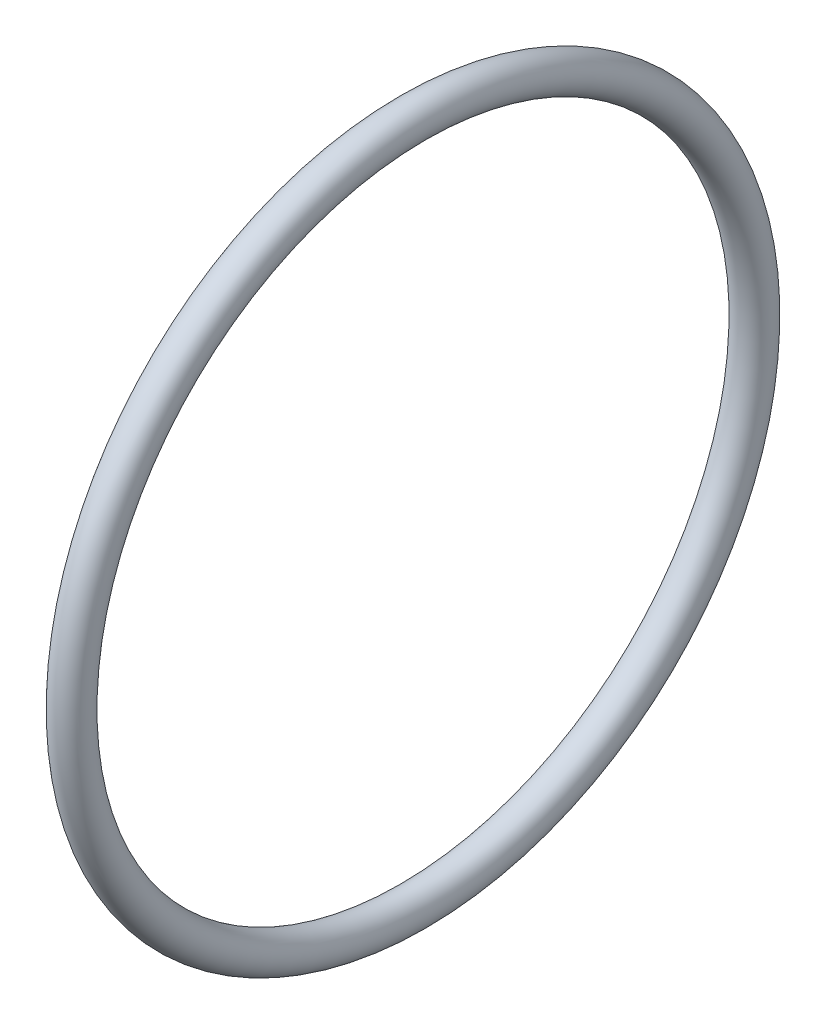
ISO-10303-21;
HEADER;
FILE_DESCRIPTION(('STEP AP214'),'2;1');
FILE_NAME('part.step','',(''),(''),'','','');
FILE_SCHEMA(('AUTOMOTIVE_DESIGN { 1 0 10303 214 1 1 1 1 }'));
ENDSEC;
DATA;
#1=APPLICATION_CONTEXT('core data for automotive mechanical design processes');
#2=APPLICATION_PROTOCOL_DEFINITION('international standard','automotive_design',2000,#1);
#3=PRODUCT_CONTEXT('',#1,'mechanical');
#4=PRODUCT('Part','Part','',(#3));
#5=PRODUCT_RELATED_PRODUCT_CATEGORY('part','',(#4));
#6=PRODUCT_DEFINITION_FORMATION('','',#4);
#7=PRODUCT_DEFINITION_CONTEXT('part definition',#1,'design');
#8=PRODUCT_DEFINITION('design','',#6,#7);
#9=PRODUCT_DEFINITION_SHAPE('','',#8);
#10=(LENGTH_UNIT() NAMED_UNIT(*) SI_UNIT(.MILLI.,.METRE.));
#11=(NAMED_UNIT(*) PLANE_ANGLE_UNIT() SI_UNIT($,.RADIAN.));
#12=(NAMED_UNIT(*) SI_UNIT($,.STERADIAN.) SOLID_ANGLE_UNIT());
#13=UNCERTAINTY_MEASURE_WITH_UNIT(LENGTH_MEASURE(1.E-05),#10,'distance_accuracy_value','');
#14=(GEOMETRIC_REPRESENTATION_CONTEXT(3) GLOBAL_UNCERTAINTY_ASSIGNED_CONTEXT((#13)) GLOBAL_UNIT_ASSIGNED_CONTEXT((#10,
#11,#12)) REPRESENTATION_CONTEXT('',''));
#15=CARTESIAN_POINT('',(0.,0.,0.));
#16=DIRECTION('',(0.,0.,1.));
#17=DIRECTION('',(1.,0.,0.));
#18=AXIS2_PLACEMENT_3D('',#15,#16,#17);
#19=CARTESIAN_POINT('',(0.,47.625,0.));
#20=DIRECTION('',(1.,0.,0.));
#21=DIRECTION('',(0.,0.,-1.));
#22=AXIS2_PLACEMENT_3D('',#19,#20,#21);
#23=TOROIDAL_SURFACE('',#22,45.24375,2.38125);
#24=CARTESIAN_POINT('',(0.,2.38125,0.));
#25=DIRECTION('',(0.,0.,1.));
#26=DIRECTION('',(1.,0.,0.));
#27=AXIS2_PLACEMENT_3D('',#24,#25,#26);
#28=CIRCLE('',#27,2.38125);
#29=CARTESIAN_POINT('',(0.,0.,0.));
#30=VERTEX_POINT('',#29);
#31=EDGE_CURVE('E10',#30,#30,#28,.T.);
#32=CARTESIAN_POINT('',(0.,47.625,0.));
#33=DIRECTION('',(1.,0.,0.));
#34=DIRECTION('',(0.,0.,-1.));
#35=AXIS2_PLACEMENT_3D('',#32,#33,#34);
#36=CIRCLE('',#35,47.625);
#37=EDGE_CURVE('',#30,#30,#36,.T.);
#38=ORIENTED_EDGE('',*,*,#31,.F.);
#39=ORIENTED_EDGE('',*,*,#31,.T.);
#40=ORIENTED_EDGE('',*,*,#37,.T.);
#41=ORIENTED_EDGE('',*,*,#37,.F.);
#42=EDGE_LOOP('',(#38,#40,#39,#41));
#43=FACE_BOUND('',#42,.T.);
#44=ADVANCED_FACE('F40',(#43),#23,.T.);
#45=CLOSED_SHELL('',(#44));
#46=MANIFOLD_SOLID_BREP('B2',#45);
#47=ADVANCED_BREP_SHAPE_REPRESENTATION('',(#18,#46),#14);
#48=SHAPE_DEFINITION_REPRESENTATION(#9,#47);
ENDSEC;
END-ISO-10303-21;
